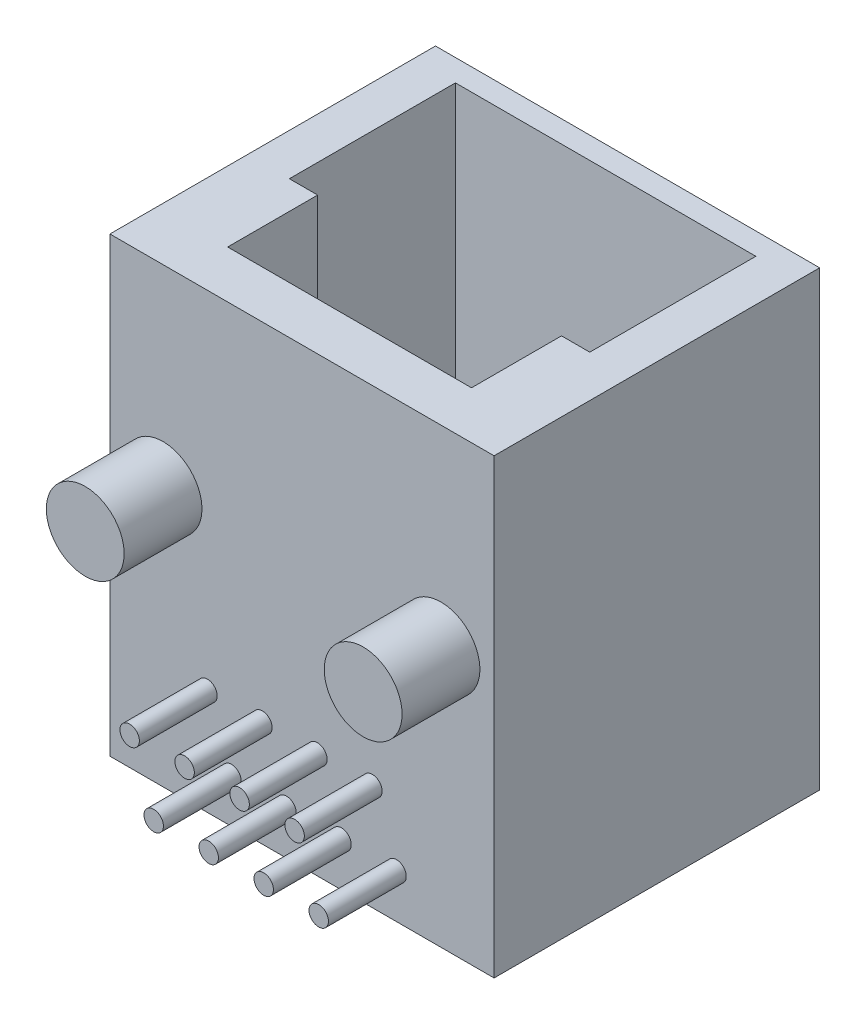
ISO-10303-21;
HEADER;
FILE_DESCRIPTION(('STEP AP214'),'2;1');
FILE_NAME('part.step','',(''),(''),'','','');
FILE_SCHEMA(('AUTOMOTIVE_DESIGN { 1 0 10303 214 1 1 1 1 }'));
ENDSEC;
DATA;
#1=APPLICATION_CONTEXT('core data for automotive mechanical design processes');
#2=APPLICATION_PROTOCOL_DEFINITION('international standard','automotive_design',2000,#1);
#3=PRODUCT_CONTEXT('',#1,'mechanical');
#4=PRODUCT('Part','Part','',(#3));
#5=PRODUCT_RELATED_PRODUCT_CATEGORY('part','',(#4));
#6=PRODUCT_DEFINITION_FORMATION('','',#4);
#7=PRODUCT_DEFINITION_CONTEXT('part definition',#1,'design');
#8=PRODUCT_DEFINITION('design','',#6,#7);
#9=PRODUCT_DEFINITION_SHAPE('','',#8);
#10=(LENGTH_UNIT() NAMED_UNIT(*) SI_UNIT(.MILLI.,.METRE.));
#11=(NAMED_UNIT(*) PLANE_ANGLE_UNIT() SI_UNIT($,.RADIAN.));
#12=(NAMED_UNIT(*) SI_UNIT($,.STERADIAN.) SOLID_ANGLE_UNIT());
#13=UNCERTAINTY_MEASURE_WITH_UNIT(LENGTH_MEASURE(1.E-05),#10,'distance_accuracy_value','');
#14=(GEOMETRIC_REPRESENTATION_CONTEXT(3) GLOBAL_UNCERTAINTY_ASSIGNED_CONTEXT((#13)) GLOBAL_UNIT_ASSIGNED_CONTEXT((#10,
#11,#12)) REPRESENTATION_CONTEXT('',''));
#15=CARTESIAN_POINT('',(0.,0.,0.));
#16=DIRECTION('',(0.,0.,1.));
#17=DIRECTION('',(1.,0.,0.));
#18=AXIS2_PLACEMENT_3D('',#15,#16,#17);
#19=CARTESIAN_POINT('',(7.9,18.6,6.695));
#20=DIRECTION('',(-1.,0.,0.));
#21=DIRECTION('',(0.,0.,1.));
#22=AXIS2_PLACEMENT_3D('',#19,#20,#21);
#23=PLANE('',#22);
#24=DIRECTION('',(0.,0.,-1.));
#25=VECTOR('',#24,1.);
#26=CARTESIAN_POINT('',(7.9,0.,6.695));
#27=LINE('',#26,#25);
#28=CARTESIAN_POINT('',(7.9,0.,6.695));
#29=VERTEX_POINT('',#28);
#30=CARTESIAN_POINT('',(7.9,0.,-6.695));
#31=VERTEX_POINT('',#30);
#32=EDGE_CURVE('E222',#29,#31,#27,.T.);
#33=ORIENTED_EDGE('',*,*,#32,.T.);
#34=DIRECTION('',(0.,-1.,0.));
#35=VECTOR('',#34,1.);
#36=CARTESIAN_POINT('',(7.9,18.6,-6.695));
#37=LINE('',#36,#35);
#38=CARTESIAN_POINT('',(7.9,18.6,-6.695));
#39=VERTEX_POINT('',#38);
#40=EDGE_CURVE('E271',#39,#31,#37,.T.);
#41=ORIENTED_EDGE('',*,*,#40,.F.);
#42=DIRECTION('',(0.,0.,-1.));
#43=VECTOR('',#42,1.);
#44=CARTESIAN_POINT('',(7.9,18.6,6.695));
#45=LINE('',#44,#43);
#46=CARTESIAN_POINT('',(7.9,18.6,6.695));
#47=VERTEX_POINT('',#46);
#48=EDGE_CURVE('E240',#47,#39,#45,.T.);
#49=ORIENTED_EDGE('',*,*,#48,.F.);
#50=DIRECTION('',(0.,-1.,0.));
#51=VECTOR('',#50,1.);
#52=CARTESIAN_POINT('',(7.9,18.6,6.695));
#53=LINE('',#52,#51);
#54=EDGE_CURVE('E250',#47,#29,#53,.T.);
#55=ORIENTED_EDGE('',*,*,#54,.T.);
#56=EDGE_LOOP('',(#33,#41,#49,#55));
#57=FACE_BOUND('',#56,.T.);
#58=ADVANCED_FACE('F43',(#57),#23,.F.);
#59=CARTESIAN_POINT('',(-7.9,18.6,-6.695));
#60=DIRECTION('',(0.,0.,1.));
#61=DIRECTION('',(1.,0.,0.));
#62=AXIS2_PLACEMENT_3D('',#59,#60,#61);
#63=PLANE('',#62);
#64=DIRECTION('',(-1.,0.,0.));
#65=VECTOR('',#64,1.);
#66=CARTESIAN_POINT('',(-7.9,0.,-6.695));
#67=LINE('',#66,#65);
#68=CARTESIAN_POINT('',(-7.9,0.,-6.695));
#69=VERTEX_POINT('',#68);
#70=EDGE_CURVE('E254',#31,#69,#67,.T.);
#71=ORIENTED_EDGE('',*,*,#70,.T.);
#72=DIRECTION('',(0.,-1.,0.));
#73=VECTOR('',#72,1.);
#74=CARTESIAN_POINT('',(-7.9,18.6,-6.695));
#75=LINE('',#74,#73);
#76=CARTESIAN_POINT('',(-7.9,18.6,-6.695));
#77=VERTEX_POINT('',#76);
#78=EDGE_CURVE('E267',#77,#69,#75,.T.);
#79=ORIENTED_EDGE('',*,*,#78,.F.);
#80=DIRECTION('',(-1.,0.,0.));
#81=VECTOR('',#80,1.);
#82=CARTESIAN_POINT('',(-7.9,18.6,-6.695));
#83=LINE('',#82,#81);
#84=EDGE_CURVE('E96',#39,#77,#83,.T.);
#85=ORIENTED_EDGE('',*,*,#84,.F.);
#86=ORIENTED_EDGE('',*,*,#40,.T.);
#87=EDGE_LOOP('',(#71,#79,#85,#86));
#88=FACE_BOUND('',#87,.T.);
#89=ADVANCED_FACE('F349',(#88),#63,.F.);
#90=CARTESIAN_POINT('',(-7.9,18.6,6.695));
#91=DIRECTION('',(1.,0.,0.));
#92=DIRECTION('',(0.,0.,-1.));
#93=AXIS2_PLACEMENT_3D('',#90,#91,#92);
#94=PLANE('',#93);
#95=DIRECTION('',(0.,0.,1.));
#96=VECTOR('',#95,1.);
#97=CARTESIAN_POINT('',(-7.9,0.,6.695));
#98=LINE('',#97,#96);
#99=CARTESIAN_POINT('',(-7.9,0.,6.695));
#100=VERTEX_POINT('',#99);
#101=EDGE_CURVE('E257',#69,#100,#98,.T.);
#102=ORIENTED_EDGE('',*,*,#101,.T.);
#103=DIRECTION('',(0.,-1.,0.));
#104=VECTOR('',#103,1.);
#105=CARTESIAN_POINT('',(-7.9,18.6,6.695));
#106=LINE('',#105,#104);
#107=CARTESIAN_POINT('',(-7.9,18.6,6.695));
#108=VERTEX_POINT('',#107);
#109=EDGE_CURVE('E264',#108,#100,#106,.T.);
#110=ORIENTED_EDGE('',*,*,#109,.F.);
#111=DIRECTION('',(0.,0.,1.));
#112=VECTOR('',#111,1.);
#113=CARTESIAN_POINT('',(-7.9,18.6,6.695));
#114=LINE('',#113,#112);
#115=EDGE_CURVE('E245',#77,#108,#114,.T.);
#116=ORIENTED_EDGE('',*,*,#115,.F.);
#117=ORIENTED_EDGE('',*,*,#78,.T.);
#118=EDGE_LOOP('',(#102,#110,#116,#117));
#119=FACE_BOUND('',#118,.T.);
#120=ADVANCED_FACE('F315',(#119),#94,.F.);
#121=CARTESIAN_POINT('',(-7.9,18.6,6.695));
#122=DIRECTION('',(0.,0.,-1.));
#123=DIRECTION('',(-1.,0.,0.));
#124=AXIS2_PLACEMENT_3D('',#121,#122,#123);
#125=PLANE('',#124);
#126=CARTESIAN_POINT('',(-2.89797,1.81,6.695));
#127=DIRECTION('',(0.,0.,-1.));
#128=DIRECTION('',(-1.,0.,0.));
#129=AXIS2_PLACEMENT_3D('',#126,#127,#128);
#130=CIRCLE('',#129,0.4);
#131=CARTESIAN_POINT('',(-3.29797,1.81,6.695));
#132=VERTEX_POINT('',#131);
#133=EDGE_CURVE('E11',#132,#132,#130,.F.);
#134=ORIENTED_EDGE('',*,*,#133,.F.);
#135=EDGE_LOOP('',(#134));
#136=FACE_BOUND('',#135,.T.);
#137=CARTESIAN_POINT('',(-0.635989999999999,1.81,6.695));
#138=DIRECTION('',(0.,0.,-1.));
#139=DIRECTION('',(-1.,0.,0.));
#140=AXIS2_PLACEMENT_3D('',#137,#138,#139);
#141=CIRCLE('',#140,0.4);
#142=CARTESIAN_POINT('',(-1.03599,1.81,6.695));
#143=VERTEX_POINT('',#142);
#144=EDGE_CURVE('E51',#143,#143,#141,.F.);
#145=ORIENTED_EDGE('',*,*,#144,.F.);
#146=EDGE_LOOP('',(#145));
#147=FACE_BOUND('',#146,.T.);
#148=CARTESIAN_POINT('',(1.62599,1.81,6.695));
#149=DIRECTION('',(0.,0.,-1.));
#150=DIRECTION('',(-1.,0.,0.));
#151=AXIS2_PLACEMENT_3D('',#148,#149,#150);
#152=CIRCLE('',#151,0.4);
#153=CARTESIAN_POINT('',(1.22599,1.81,6.695));
#154=VERTEX_POINT('',#153);
#155=EDGE_CURVE('E302',#154,#154,#152,.F.);
#156=ORIENTED_EDGE('',*,*,#155,.F.);
#157=EDGE_LOOP('',(#156));
#158=FACE_BOUND('',#157,.T.);
#159=CARTESIAN_POINT('',(3.88797,1.81,6.695));
#160=DIRECTION('',(0.,0.,-1.));
#161=DIRECTION('',(-1.,0.,0.));
#162=AXIS2_PLACEMENT_3D('',#159,#160,#161);
#163=CIRCLE('',#162,0.4);
#164=CARTESIAN_POINT('',(3.48797,1.81,6.695));
#165=VERTEX_POINT('',#164);
#166=EDGE_CURVE('E298',#165,#165,#163,.F.);
#167=ORIENTED_EDGE('',*,*,#166,.F.);
#168=EDGE_LOOP('',(#167));
#169=FACE_BOUND('',#168,.T.);
#170=CARTESIAN_POINT('',(-1.62797,4.35,6.695));
#171=DIRECTION('',(0.,0.,-1.));
#172=DIRECTION('',(-1.,0.,0.));
#173=AXIS2_PLACEMENT_3D('',#170,#171,#172);
#174=CIRCLE('',#173,0.4);
#175=CARTESIAN_POINT('',(-2.02797,4.35,6.695));
#176=VERTEX_POINT('',#175);
#177=EDGE_CURVE('E294',#176,#176,#174,.F.);
#178=ORIENTED_EDGE('',*,*,#177,.F.);
#179=EDGE_LOOP('',(#178));
#180=FACE_BOUND('',#179,.T.);
#181=CARTESIAN_POINT('',(0.634010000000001,4.35,6.695));
#182=DIRECTION('',(0.,0.,-1.));
#183=DIRECTION('',(-1.,0.,0.));
#184=AXIS2_PLACEMENT_3D('',#181,#182,#183);
#185=CIRCLE('',#184,0.4);
#186=CARTESIAN_POINT('',(0.234010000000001,4.35,6.695));
#187=VERTEX_POINT('',#186);
#188=EDGE_CURVE('E290',#187,#187,#185,.F.);
#189=ORIENTED_EDGE('',*,*,#188,.F.);
#190=EDGE_LOOP('',(#189));
#191=FACE_BOUND('',#190,.T.);
#192=CARTESIAN_POINT('',(2.89599,4.35,6.695));
#193=DIRECTION('',(0.,0.,-1.));
#194=DIRECTION('',(-1.,0.,0.));
#195=AXIS2_PLACEMENT_3D('',#192,#193,#194);
#196=CIRCLE('',#195,0.4);
#197=CARTESIAN_POINT('',(2.49599,4.35,6.695));
#198=VERTEX_POINT('',#197);
#199=EDGE_CURVE('E286',#198,#198,#196,.F.);
#200=ORIENTED_EDGE('',*,*,#199,.F.);
#201=EDGE_LOOP('',(#200));
#202=FACE_BOUND('',#201,.T.);
#203=CARTESIAN_POINT('',(-3.88797,4.35,6.695));
#204=DIRECTION('',(0.,0.,-1.));
#205=DIRECTION('',(-1.,0.,0.));
#206=AXIS2_PLACEMENT_3D('',#203,#204,#205);
#207=CIRCLE('',#206,0.4);
#208=CARTESIAN_POINT('',(-4.28797,4.35,6.695));
#209=VERTEX_POINT('',#208);
#210=EDGE_CURVE('E282',#209,#209,#207,.F.);
#211=ORIENTED_EDGE('',*,*,#210,.F.);
#212=EDGE_LOOP('',(#211));
#213=FACE_BOUND('',#212,.T.);
#214=CARTESIAN_POINT('',(5.715,10.7,6.695));
#215=DIRECTION('',(0.,0.,-1.));
#216=DIRECTION('',(-1.,0.,0.));
#217=AXIS2_PLACEMENT_3D('',#214,#215,#216);
#218=CIRCLE('',#217,1.6);
#219=CARTESIAN_POINT('',(4.115,10.7,6.695));
#220=VERTEX_POINT('',#219);
#221=EDGE_CURVE('E278',#220,#220,#218,.F.);
#222=ORIENTED_EDGE('',*,*,#221,.F.);
#223=EDGE_LOOP('',(#222));
#224=FACE_BOUND('',#223,.T.);
#225=CARTESIAN_POINT('',(-5.715,10.7,6.695));
#226=DIRECTION('',(0.,0.,-1.));
#227=DIRECTION('',(-1.,0.,0.));
#228=AXIS2_PLACEMENT_3D('',#225,#226,#227);
#229=CIRCLE('',#228,1.6);
#230=CARTESIAN_POINT('',(-7.315,10.7,6.695));
#231=VERTEX_POINT('',#230);
#232=EDGE_CURVE('E274',#231,#231,#229,.F.);
#233=ORIENTED_EDGE('',*,*,#232,.F.);
#234=EDGE_LOOP('',(#233));
#235=FACE_BOUND('',#234,.T.);
#236=DIRECTION('',(1.,0.,0.));
#237=VECTOR('',#236,1.);
#238=CARTESIAN_POINT('',(-7.9,0.,6.695));
#239=LINE('',#238,#237);
#240=EDGE_CURVE('E88',#100,#29,#239,.T.);
#241=ORIENTED_EDGE('',*,*,#240,.T.);
#242=ORIENTED_EDGE('',*,*,#54,.F.);
#243=DIRECTION('',(1.,0.,0.));
#244=VECTOR('',#243,1.);
#245=CARTESIAN_POINT('',(-7.9,18.6,6.695));
#246=LINE('',#245,#244);
#247=EDGE_CURVE('E67',#108,#47,#246,.T.);
#248=ORIENTED_EDGE('',*,*,#247,.F.);
#249=ORIENTED_EDGE('',*,*,#109,.T.);
#250=EDGE_LOOP('',(#241,#242,#248,#249));
#251=FACE_BOUND('',#250,.T.);
#252=ADVANCED_FACE('F311',(#136,#147,#158,#169,#180,#191,#202,#213,#224,#235,#251),#125,.F.);
#253=CARTESIAN_POINT('',(0.,18.6,0.));
#254=DIRECTION('',(0.,-1.,0.));
#255=DIRECTION('',(0.,0.,-1.));
#256=AXIS2_PLACEMENT_3D('',#253,#254,#255);
#257=PLANE('',#256);
#258=DIRECTION('',(-1.,0.,0.));
#259=VECTOR('',#258,1.);
#260=CARTESIAN_POINT('',(-6.17696518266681,18.6,-5.79258095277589));
#261=LINE('',#260,#259);
#262=CARTESIAN_POINT('',(6.17696518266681,18.6,-5.79258095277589));
#263=VERTEX_POINT('',#262);
#264=CARTESIAN_POINT('',(-6.17696518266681,18.6,-5.79258095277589));
#265=VERTEX_POINT('',#264);
#266=EDGE_CURVE('E197',#263,#265,#261,.T.);
#267=ORIENTED_EDGE('',*,*,#266,.F.);
#268=DIRECTION('',(0.,0.,-1.));
#269=VECTOR('',#268,1.);
#270=CARTESIAN_POINT('',(6.17696518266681,18.6,1.0369435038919));
#271=LINE('',#270,#269);
#272=CARTESIAN_POINT('',(6.17696518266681,18.6,1.0369435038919));
#273=VERTEX_POINT('',#272);
#274=EDGE_CURVE('E58',#273,#263,#271,.T.);
#275=ORIENTED_EDGE('',*,*,#274,.F.);
#276=DIRECTION('',(1.,0.,0.));
#277=VECTOR('',#276,1.);
#278=CARTESIAN_POINT('',(5.01487332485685,18.6,1.0369435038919));
#279=LINE('',#278,#277);
#280=CARTESIAN_POINT('',(5.01487332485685,18.6,1.0369435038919));
#281=VERTEX_POINT('',#280);
#282=EDGE_CURVE('E166',#281,#273,#279,.T.);
#283=ORIENTED_EDGE('',*,*,#282,.F.);
#284=DIRECTION('',(0.,0.,-1.));
#285=VECTOR('',#284,1.);
#286=CARTESIAN_POINT('',(5.01487332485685,18.6,4.73775911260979));
#287=LINE('',#286,#285);
#288=CARTESIAN_POINT('',(5.01487332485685,18.6,4.73775911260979));
#289=VERTEX_POINT('',#288);
#290=EDGE_CURVE('E170',#289,#281,#287,.T.);
#291=ORIENTED_EDGE('',*,*,#290,.F.);
#292=DIRECTION('',(1.,0.,0.));
#293=VECTOR('',#292,1.);
#294=CARTESIAN_POINT('',(-5.01487332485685,18.6,4.73775911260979));
#295=LINE('',#294,#293);
#296=CARTESIAN_POINT('',(-5.01487332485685,18.6,4.73775911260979));
#297=VERTEX_POINT('',#296);
#298=EDGE_CURVE('E212',#297,#289,#295,.T.);
#299=ORIENTED_EDGE('',*,*,#298,.F.);
#300=DIRECTION('',(0.,0.,1.));
#301=VECTOR('',#300,1.);
#302=CARTESIAN_POINT('',(-5.01487332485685,18.6,4.73775911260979));
#303=LINE('',#302,#301);
#304=CARTESIAN_POINT('',(-5.01487332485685,18.6,1.0369435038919));
#305=VERTEX_POINT('',#304);
#306=EDGE_CURVE('E208',#305,#297,#303,.T.);
#307=ORIENTED_EDGE('',*,*,#306,.F.);
#308=DIRECTION('',(1.,0.,0.));
#309=VECTOR('',#308,1.);
#310=CARTESIAN_POINT('',(-6.17696518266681,18.6,1.0369435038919));
#311=LINE('',#310,#309);
#312=CARTESIAN_POINT('',(-6.17696518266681,18.6,1.0369435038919));
#313=VERTEX_POINT('',#312);
#314=EDGE_CURVE('E204',#313,#305,#311,.T.);
#315=ORIENTED_EDGE('',*,*,#314,.F.);
#316=DIRECTION('',(0.,0.,1.));
#317=VECTOR('',#316,1.);
#318=CARTESIAN_POINT('',(-6.17696518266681,18.6,1.0369435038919));
#319=LINE('',#318,#317);
#320=EDGE_CURVE('E200',#265,#313,#319,.T.);
#321=ORIENTED_EDGE('',*,*,#320,.F.);
#322=EDGE_LOOP('',(#267,#275,#283,#291,#299,#307,#315,#321));
#323=FACE_BOUND('',#322,.T.);
#324=ORIENTED_EDGE('',*,*,#48,.T.);
#325=ORIENTED_EDGE('',*,*,#84,.T.);
#326=ORIENTED_EDGE('',*,*,#115,.T.);
#327=ORIENTED_EDGE('',*,*,#247,.T.);
#328=EDGE_LOOP('',(#324,#325,#326,#327));
#329=FACE_BOUND('',#328,.T.);
#330=ADVANCED_FACE('F314',(#323,#329),#257,.F.);
#331=CARTESIAN_POINT('',(0.,0.,0.));
#332=DIRECTION('',(0.,-1.,0.));
#333=DIRECTION('',(0.,0.,-1.));
#334=AXIS2_PLACEMENT_3D('',#331,#332,#333);
#335=PLANE('',#334);
#336=ORIENTED_EDGE('',*,*,#32,.F.);
#337=ORIENTED_EDGE('',*,*,#240,.F.);
#338=ORIENTED_EDGE('',*,*,#101,.F.);
#339=ORIENTED_EDGE('',*,*,#70,.F.);
#340=EDGE_LOOP('',(#336,#337,#338,#339));
#341=FACE_BOUND('',#340,.T.);
#342=ADVANCED_FACE('F358',(#341),#335,.T.);
#343=CARTESIAN_POINT('',(6.17696518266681,4.,1.0369435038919));
#344=DIRECTION('',(1.,0.,0.));
#345=DIRECTION('',(0.,0.,-1.));
#346=AXIS2_PLACEMENT_3D('',#343,#344,#345);
#347=PLANE('',#346);
#348=ORIENTED_EDGE('',*,*,#274,.T.);
#349=DIRECTION('',(0.,1.,0.));
#350=VECTOR('',#349,1.);
#351=CARTESIAN_POINT('',(6.17696518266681,4.,-5.79258095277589));
#352=LINE('',#351,#350);
#353=CARTESIAN_POINT('',(6.17696518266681,4.,-5.79258095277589));
#354=VERTEX_POINT('',#353);
#355=EDGE_CURVE('E140',#354,#263,#352,.T.);
#356=ORIENTED_EDGE('',*,*,#355,.F.);
#357=DIRECTION('',(0.,0.,-1.));
#358=VECTOR('',#357,1.);
#359=CARTESIAN_POINT('',(6.17696518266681,4.,1.0369435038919));
#360=LINE('',#359,#358);
#361=CARTESIAN_POINT('',(6.17696518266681,4.,1.0369435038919));
#362=VERTEX_POINT('',#361);
#363=EDGE_CURVE('E144',#362,#354,#360,.T.);
#364=ORIENTED_EDGE('',*,*,#363,.F.);
#365=DIRECTION('',(0.,1.,0.));
#366=VECTOR('',#365,1.);
#367=CARTESIAN_POINT('',(6.17696518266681,4.,1.0369435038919));
#368=LINE('',#367,#366);
#369=EDGE_CURVE('E219',#362,#273,#368,.T.);
#370=ORIENTED_EDGE('',*,*,#369,.T.);
#371=EDGE_LOOP('',(#348,#356,#364,#370));
#372=FACE_BOUND('',#371,.T.);
#373=ADVANCED_FACE('F142',(#372),#347,.F.);
#374=CARTESIAN_POINT('',(5.01487332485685,4.,1.0369435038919));
#375=DIRECTION('',(0.,0.,1.));
#376=DIRECTION('',(1.,0.,0.));
#377=AXIS2_PLACEMENT_3D('',#374,#375,#376);
#378=PLANE('',#377);
#379=ORIENTED_EDGE('',*,*,#282,.T.);
#380=ORIENTED_EDGE('',*,*,#369,.F.);
#381=DIRECTION('',(1.,0.,0.));
#382=VECTOR('',#381,1.);
#383=CARTESIAN_POINT('',(5.01487332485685,4.,1.0369435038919));
#384=LINE('',#383,#382);
#385=CARTESIAN_POINT('',(5.01487332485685,4.,1.0369435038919));
#386=VERTEX_POINT('',#385);
#387=EDGE_CURVE('E151',#386,#362,#384,.T.);
#388=ORIENTED_EDGE('',*,*,#387,.F.);
#389=DIRECTION('',(0.,1.,0.));
#390=VECTOR('',#389,1.);
#391=CARTESIAN_POINT('',(5.01487332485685,4.,1.0369435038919));
#392=LINE('',#391,#390);
#393=EDGE_CURVE('E223',#386,#281,#392,.T.);
#394=ORIENTED_EDGE('',*,*,#393,.T.);
#395=EDGE_LOOP('',(#379,#380,#388,#394));
#396=FACE_BOUND('',#395,.T.);
#397=ADVANCED_FACE('F677',(#396),#378,.F.);
#398=CARTESIAN_POINT('',(5.01487332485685,4.,4.73775911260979));
#399=DIRECTION('',(1.,0.,0.));
#400=DIRECTION('',(0.,0.,-1.));
#401=AXIS2_PLACEMENT_3D('',#398,#399,#400);
#402=PLANE('',#401);
#403=ORIENTED_EDGE('',*,*,#290,.T.);
#404=ORIENTED_EDGE('',*,*,#393,.F.);
#405=DIRECTION('',(0.,0.,-1.));
#406=VECTOR('',#405,1.);
#407=CARTESIAN_POINT('',(5.01487332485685,4.,4.73775911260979));
#408=LINE('',#407,#406);
#409=CARTESIAN_POINT('',(5.01487332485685,4.,4.73775911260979));
#410=VERTEX_POINT('',#409);
#411=EDGE_CURVE('E190',#410,#386,#408,.T.);
#412=ORIENTED_EDGE('',*,*,#411,.F.);
#413=DIRECTION('',(0.,1.,0.));
#414=VECTOR('',#413,1.);
#415=CARTESIAN_POINT('',(5.01487332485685,4.,4.73775911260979));
#416=LINE('',#415,#414);
#417=EDGE_CURVE('E226',#410,#289,#416,.T.);
#418=ORIENTED_EDGE('',*,*,#417,.T.);
#419=EDGE_LOOP('',(#403,#404,#412,#418));
#420=FACE_BOUND('',#419,.T.);
#421=ADVANCED_FACE('F667',(#420),#402,.F.);
#422=CARTESIAN_POINT('',(-5.01487332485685,4.,4.73775911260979));
#423=DIRECTION('',(0.,0.,1.));
#424=DIRECTION('',(1.,0.,0.));
#425=AXIS2_PLACEMENT_3D('',#422,#423,#424);
#426=PLANE('',#425);
#427=ORIENTED_EDGE('',*,*,#298,.T.);
#428=ORIENTED_EDGE('',*,*,#417,.F.);
#429=DIRECTION('',(1.,0.,0.));
#430=VECTOR('',#429,1.);
#431=CARTESIAN_POINT('',(-5.01487332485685,4.,4.73775911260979));
#432=LINE('',#431,#430);
#433=CARTESIAN_POINT('',(-5.01487332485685,4.,4.73775911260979));
#434=VERTEX_POINT('',#433);
#435=EDGE_CURVE('E186',#434,#410,#432,.T.);
#436=ORIENTED_EDGE('',*,*,#435,.F.);
#437=DIRECTION('',(0.,1.,0.));
#438=VECTOR('',#437,1.);
#439=CARTESIAN_POINT('',(-5.01487332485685,4.,4.73775911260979));
#440=LINE('',#439,#438);
#441=EDGE_CURVE('E229',#434,#297,#440,.T.);
#442=ORIENTED_EDGE('',*,*,#441,.T.);
#443=EDGE_LOOP('',(#427,#428,#436,#442));
#444=FACE_BOUND('',#443,.T.);
#445=ADVANCED_FACE('F657',(#444),#426,.F.);
#446=CARTESIAN_POINT('',(-5.01487332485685,4.,4.73775911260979));
#447=DIRECTION('',(-1.,0.,0.));
#448=DIRECTION('',(0.,0.,1.));
#449=AXIS2_PLACEMENT_3D('',#446,#447,#448);
#450=PLANE('',#449);
#451=ORIENTED_EDGE('',*,*,#306,.T.);
#452=ORIENTED_EDGE('',*,*,#441,.F.);
#453=DIRECTION('',(0.,0.,1.));
#454=VECTOR('',#453,1.);
#455=CARTESIAN_POINT('',(-5.01487332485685,4.,4.73775911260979));
#456=LINE('',#455,#454);
#457=CARTESIAN_POINT('',(-5.01487332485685,4.,1.0369435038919));
#458=VERTEX_POINT('',#457);
#459=EDGE_CURVE('E182',#458,#434,#456,.T.);
#460=ORIENTED_EDGE('',*,*,#459,.F.);
#461=DIRECTION('',(0.,1.,0.));
#462=VECTOR('',#461,1.);
#463=CARTESIAN_POINT('',(-5.01487332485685,4.,1.0369435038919));
#464=LINE('',#463,#462);
#465=EDGE_CURVE('E232',#458,#305,#464,.T.);
#466=ORIENTED_EDGE('',*,*,#465,.T.);
#467=EDGE_LOOP('',(#451,#452,#460,#466));
#468=FACE_BOUND('',#467,.T.);
#469=ADVANCED_FACE('F647',(#468),#450,.F.);
#470=CARTESIAN_POINT('',(-6.17696518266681,4.,1.0369435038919));
#471=DIRECTION('',(0.,0.,1.));
#472=DIRECTION('',(1.,0.,0.));
#473=AXIS2_PLACEMENT_3D('',#470,#471,#472);
#474=PLANE('',#473);
#475=ORIENTED_EDGE('',*,*,#314,.T.);
#476=ORIENTED_EDGE('',*,*,#465,.F.);
#477=DIRECTION('',(1.,0.,0.));
#478=VECTOR('',#477,1.);
#479=CARTESIAN_POINT('',(-6.17696518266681,4.,1.0369435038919));
#480=LINE('',#479,#478);
#481=CARTESIAN_POINT('',(-6.17696518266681,4.,1.0369435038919));
#482=VERTEX_POINT('',#481);
#483=EDGE_CURVE('E178',#482,#458,#480,.T.);
#484=ORIENTED_EDGE('',*,*,#483,.F.);
#485=DIRECTION('',(0.,1.,0.));
#486=VECTOR('',#485,1.);
#487=CARTESIAN_POINT('',(-6.17696518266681,4.,1.0369435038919));
#488=LINE('',#487,#486);
#489=EDGE_CURVE('E235',#482,#313,#488,.T.);
#490=ORIENTED_EDGE('',*,*,#489,.T.);
#491=EDGE_LOOP('',(#475,#476,#484,#490));
#492=FACE_BOUND('',#491,.T.);
#493=ADVANCED_FACE('F637',(#492),#474,.F.);
#494=CARTESIAN_POINT('',(-6.17696518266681,4.,1.0369435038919));
#495=DIRECTION('',(-1.,0.,0.));
#496=DIRECTION('',(0.,0.,1.));
#497=AXIS2_PLACEMENT_3D('',#494,#495,#496);
#498=PLANE('',#497);
#499=ORIENTED_EDGE('',*,*,#320,.T.);
#500=ORIENTED_EDGE('',*,*,#489,.F.);
#501=DIRECTION('',(0.,0.,1.));
#502=VECTOR('',#501,1.);
#503=CARTESIAN_POINT('',(-6.17696518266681,4.,1.0369435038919));
#504=LINE('',#503,#502);
#505=CARTESIAN_POINT('',(-6.17696518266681,4.,-5.79258095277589));
#506=VERTEX_POINT('',#505);
#507=EDGE_CURVE('E160',#506,#482,#504,.T.);
#508=ORIENTED_EDGE('',*,*,#507,.F.);
#509=DIRECTION('',(0.,1.,0.));
#510=VECTOR('',#509,1.);
#511=CARTESIAN_POINT('',(-6.17696518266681,4.,-5.79258095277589));
#512=LINE('',#511,#510);
#513=EDGE_CURVE('E150',#506,#265,#512,.T.);
#514=ORIENTED_EDGE('',*,*,#513,.T.);
#515=EDGE_LOOP('',(#499,#500,#508,#514));
#516=FACE_BOUND('',#515,.T.);
#517=ADVANCED_FACE('F630',(#516),#498,.F.);
#518=CARTESIAN_POINT('',(-6.17696518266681,4.,-5.79258095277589));
#519=DIRECTION('',(0.,0.,-1.));
#520=DIRECTION('',(-1.,0.,0.));
#521=AXIS2_PLACEMENT_3D('',#518,#519,#520);
#522=PLANE('',#521);
#523=ORIENTED_EDGE('',*,*,#266,.T.);
#524=ORIENTED_EDGE('',*,*,#513,.F.);
#525=DIRECTION('',(-1.,0.,0.));
#526=VECTOR('',#525,1.);
#527=CARTESIAN_POINT('',(-6.17696518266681,4.,-5.79258095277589));
#528=LINE('',#527,#526);
#529=EDGE_CURVE('E154',#354,#506,#528,.T.);
#530=ORIENTED_EDGE('',*,*,#529,.F.);
#531=ORIENTED_EDGE('',*,*,#355,.T.);
#532=EDGE_LOOP('',(#523,#524,#530,#531));
#533=FACE_BOUND('',#532,.T.);
#534=ADVANCED_FACE('F155',(#533),#522,.F.);
#535=CARTESIAN_POINT('',(0.,4.,0.));
#536=DIRECTION('',(0.,-1.,0.));
#537=DIRECTION('',(0.,0.,-1.));
#538=AXIS2_PLACEMENT_3D('',#535,#536,#537);
#539=PLANE('',#538);
#540=ORIENTED_EDGE('',*,*,#363,.T.);
#541=ORIENTED_EDGE('',*,*,#529,.T.);
#542=ORIENTED_EDGE('',*,*,#507,.T.);
#543=ORIENTED_EDGE('',*,*,#483,.T.);
#544=ORIENTED_EDGE('',*,*,#459,.T.);
#545=ORIENTED_EDGE('',*,*,#435,.T.);
#546=ORIENTED_EDGE('',*,*,#411,.T.);
#547=ORIENTED_EDGE('',*,*,#387,.T.);
#548=EDGE_LOOP('',(#540,#541,#542,#543,#544,#545,#546,#547));
#549=FACE_BOUND('',#548,.T.);
#550=ADVANCED_FACE('F162',(#549),#539,.F.);
#551=CARTESIAN_POINT('',(-5.715,10.7,9.895));
#552=DIRECTION('',(0.,0.,-1.));
#553=DIRECTION('',(-1.,0.,0.));
#554=AXIS2_PLACEMENT_3D('',#551,#552,#553);
#555=CYLINDRICAL_SURFACE('',#554,1.6);
#556=CARTESIAN_POINT('',(-5.715,10.7,9.895));
#557=DIRECTION('',(0.,0.,1.));
#558=DIRECTION('',(1.,0.,0.));
#559=AXIS2_PLACEMENT_3D('',#556,#557,#558);
#560=CIRCLE('',#559,1.6);
#561=CARTESIAN_POINT('',(-4.115,10.7,9.895));
#562=VERTEX_POINT('',#561);
#563=EDGE_CURVE('E173',#562,#562,#560,.T.);
#564=ORIENTED_EDGE('',*,*,#563,.F.);
#565=EDGE_LOOP('',(#564));
#566=FACE_BOUND('',#565,.T.);
#567=ORIENTED_EDGE('',*,*,#232,.T.);
#568=EDGE_LOOP('',(#567));
#569=FACE_BOUND('',#568,.T.);
#570=ADVANCED_FACE('F334',(#566,#569),#555,.T.);
#571=CARTESIAN_POINT('',(-5.715,10.7,9.895));
#572=DIRECTION('',(0.,0.,1.));
#573=DIRECTION('',(1.,0.,0.));
#574=AXIS2_PLACEMENT_3D('',#571,#572,#573);
#575=PLANE('',#574);
#576=ORIENTED_EDGE('',*,*,#563,.T.);
#577=EDGE_LOOP('',(#576));
#578=FACE_BOUND('',#577,.T.);
#579=ADVANCED_FACE('F336',(#578),#575,.T.);
#580=CARTESIAN_POINT('',(5.715,10.7,9.895));
#581=DIRECTION('',(0.,0.,-1.));
#582=DIRECTION('',(-1.,0.,0.));
#583=AXIS2_PLACEMENT_3D('',#580,#581,#582);
#584=CYLINDRICAL_SURFACE('',#583,1.6);
#585=CARTESIAN_POINT('',(5.715,10.7,9.895));
#586=DIRECTION('',(0.,0.,1.));
#587=DIRECTION('',(1.,0.,0.));
#588=AXIS2_PLACEMENT_3D('',#585,#586,#587);
#589=CIRCLE('',#588,1.6);
#590=CARTESIAN_POINT('',(7.315,10.7,9.895));
#591=VERTEX_POINT('',#590);
#592=EDGE_CURVE('E787',#591,#591,#589,.T.);
#593=ORIENTED_EDGE('',*,*,#592,.F.);
#594=EDGE_LOOP('',(#593));
#595=FACE_BOUND('',#594,.T.);
#596=ORIENTED_EDGE('',*,*,#221,.T.);
#597=EDGE_LOOP('',(#596));
#598=FACE_BOUND('',#597,.T.);
#599=ADVANCED_FACE('F343',(#595,#598),#584,.T.);
#600=CARTESIAN_POINT('',(5.715,10.7,9.895));
#601=DIRECTION('',(0.,0.,1.));
#602=DIRECTION('',(1.,0.,0.));
#603=AXIS2_PLACEMENT_3D('',#600,#601,#602);
#604=PLANE('',#603);
#605=ORIENTED_EDGE('',*,*,#592,.T.);
#606=EDGE_LOOP('',(#605));
#607=FACE_BOUND('',#606,.T.);
#608=ADVANCED_FACE('F410',(#607),#604,.T.);
#609=CARTESIAN_POINT('',(-3.88797,4.35,9.895));
#610=DIRECTION('',(0.,0.,-1.));
#611=DIRECTION('',(-1.,0.,0.));
#612=AXIS2_PLACEMENT_3D('',#609,#610,#611);
#613=CYLINDRICAL_SURFACE('',#612,0.4);
#614=CARTESIAN_POINT('',(-3.88797,4.35,9.895));
#615=DIRECTION('',(0.,0.,1.));
#616=DIRECTION('',(1.,0.,0.));
#617=AXIS2_PLACEMENT_3D('',#614,#615,#616);
#618=CIRCLE('',#617,0.4);
#619=CARTESIAN_POINT('',(-3.48797,4.35,9.895));
#620=VERTEX_POINT('',#619);
#621=EDGE_CURVE('E784',#620,#620,#618,.T.);
#622=ORIENTED_EDGE('',*,*,#621,.F.);
#623=EDGE_LOOP('',(#622));
#624=FACE_BOUND('',#623,.T.);
#625=ORIENTED_EDGE('',*,*,#210,.T.);
#626=EDGE_LOOP('',(#625));
#627=FACE_BOUND('',#626,.T.);
#628=ADVANCED_FACE('F421',(#624,#627),#613,.T.);
#629=CARTESIAN_POINT('',(-3.88797,4.35,9.895));
#630=DIRECTION('',(0.,0.,1.));
#631=DIRECTION('',(1.,0.,0.));
#632=AXIS2_PLACEMENT_3D('',#629,#630,#631);
#633=PLANE('',#632);
#634=ORIENTED_EDGE('',*,*,#621,.T.);
#635=EDGE_LOOP('',(#634));
#636=FACE_BOUND('',#635,.T.);
#637=ADVANCED_FACE('F432',(#636),#633,.T.);
#638=CARTESIAN_POINT('',(2.89599,4.35,9.895));
#639=DIRECTION('',(0.,0.,-1.));
#640=DIRECTION('',(-1.,0.,0.));
#641=AXIS2_PLACEMENT_3D('',#638,#639,#640);
#642=CYLINDRICAL_SURFACE('',#641,0.4);
#643=CARTESIAN_POINT('',(2.89599,4.35,9.895));
#644=DIRECTION('',(0.,0.,1.));
#645=DIRECTION('',(1.,0.,0.));
#646=AXIS2_PLACEMENT_3D('',#643,#644,#645);
#647=CIRCLE('',#646,0.4);
#648=CARTESIAN_POINT('',(3.29599,4.35,9.895));
#649=VERTEX_POINT('',#648);
#650=EDGE_CURVE('E780',#649,#649,#647,.T.);
#651=ORIENTED_EDGE('',*,*,#650,.F.);
#652=EDGE_LOOP('',(#651));
#653=FACE_BOUND('',#652,.T.);
#654=ORIENTED_EDGE('',*,*,#199,.T.);
#655=EDGE_LOOP('',(#654));
#656=FACE_BOUND('',#655,.T.);
#657=ADVANCED_FACE('F443',(#653,#656),#642,.T.);
#658=CARTESIAN_POINT('',(2.89599,4.35,9.895));
#659=DIRECTION('',(0.,0.,1.));
#660=DIRECTION('',(1.,0.,0.));
#661=AXIS2_PLACEMENT_3D('',#658,#659,#660);
#662=PLANE('',#661);
#663=ORIENTED_EDGE('',*,*,#650,.T.);
#664=EDGE_LOOP('',(#663));
#665=FACE_BOUND('',#664,.T.);
#666=ADVANCED_FACE('F454',(#665),#662,.T.);
#667=CARTESIAN_POINT('',(0.634010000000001,4.35,9.895));
#668=DIRECTION('',(0.,0.,-1.));
#669=DIRECTION('',(-1.,0.,0.));
#670=AXIS2_PLACEMENT_3D('',#667,#668,#669);
#671=CYLINDRICAL_SURFACE('',#670,0.4);
#672=CARTESIAN_POINT('',(0.634010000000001,4.35,9.895));
#673=DIRECTION('',(0.,0.,1.));
#674=DIRECTION('',(1.,0.,0.));
#675=AXIS2_PLACEMENT_3D('',#672,#673,#674);
#676=CIRCLE('',#675,0.4);
#677=CARTESIAN_POINT('',(1.03401,4.35,9.895));
#678=VERTEX_POINT('',#677);
#679=EDGE_CURVE('E776',#678,#678,#676,.T.);
#680=ORIENTED_EDGE('',*,*,#679,.F.);
#681=EDGE_LOOP('',(#680));
#682=FACE_BOUND('',#681,.T.);
#683=ORIENTED_EDGE('',*,*,#188,.T.);
#684=EDGE_LOOP('',(#683));
#685=FACE_BOUND('',#684,.T.);
#686=ADVANCED_FACE('F465',(#682,#685),#671,.T.);
#687=CARTESIAN_POINT('',(0.634010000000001,4.35,9.895));
#688=DIRECTION('',(0.,0.,1.));
#689=DIRECTION('',(1.,0.,0.));
#690=AXIS2_PLACEMENT_3D('',#687,#688,#689);
#691=PLANE('',#690);
#692=ORIENTED_EDGE('',*,*,#679,.T.);
#693=EDGE_LOOP('',(#692));
#694=FACE_BOUND('',#693,.T.);
#695=ADVANCED_FACE('F476',(#694),#691,.T.);
#696=CARTESIAN_POINT('',(-1.62797,4.35,9.895));
#697=DIRECTION('',(0.,0.,-1.));
#698=DIRECTION('',(-1.,0.,0.));
#699=AXIS2_PLACEMENT_3D('',#696,#697,#698);
#700=CYLINDRICAL_SURFACE('',#699,0.4);
#701=CARTESIAN_POINT('',(-1.62797,4.35,9.895));
#702=DIRECTION('',(0.,0.,1.));
#703=DIRECTION('',(1.,0.,0.));
#704=AXIS2_PLACEMENT_3D('',#701,#702,#703);
#705=CIRCLE('',#704,0.4);
#706=CARTESIAN_POINT('',(-1.22797,4.35,9.895));
#707=VERTEX_POINT('',#706);
#708=EDGE_CURVE('E772',#707,#707,#705,.T.);
#709=ORIENTED_EDGE('',*,*,#708,.F.);
#710=EDGE_LOOP('',(#709));
#711=FACE_BOUND('',#710,.T.);
#712=ORIENTED_EDGE('',*,*,#177,.T.);
#713=EDGE_LOOP('',(#712));
#714=FACE_BOUND('',#713,.T.);
#715=ADVANCED_FACE('F487',(#711,#714),#700,.T.);
#716=CARTESIAN_POINT('',(-1.62797,4.35,9.895));
#717=DIRECTION('',(0.,0.,1.));
#718=DIRECTION('',(1.,0.,0.));
#719=AXIS2_PLACEMENT_3D('',#716,#717,#718);
#720=PLANE('',#719);
#721=ORIENTED_EDGE('',*,*,#708,.T.);
#722=EDGE_LOOP('',(#721));
#723=FACE_BOUND('',#722,.T.);
#724=ADVANCED_FACE('F498',(#723),#720,.T.);
#725=CARTESIAN_POINT('',(3.88797,1.81,9.895));
#726=DIRECTION('',(0.,0.,-1.));
#727=DIRECTION('',(-1.,0.,0.));
#728=AXIS2_PLACEMENT_3D('',#725,#726,#727);
#729=CYLINDRICAL_SURFACE('',#728,0.4);
#730=CARTESIAN_POINT('',(3.88797,1.81,9.895));
#731=DIRECTION('',(0.,0.,1.));
#732=DIRECTION('',(1.,0.,0.));
#733=AXIS2_PLACEMENT_3D('',#730,#731,#732);
#734=CIRCLE('',#733,0.4);
#735=CARTESIAN_POINT('',(4.28797,1.81,9.895));
#736=VERTEX_POINT('',#735);
#737=EDGE_CURVE('E768',#736,#736,#734,.T.);
#738=ORIENTED_EDGE('',*,*,#737,.F.);
#739=EDGE_LOOP('',(#738));
#740=FACE_BOUND('',#739,.T.);
#741=ORIENTED_EDGE('',*,*,#166,.T.);
#742=EDGE_LOOP('',(#741));
#743=FACE_BOUND('',#742,.T.);
#744=ADVANCED_FACE('F509',(#740,#743),#729,.T.);
#745=CARTESIAN_POINT('',(3.88797,1.81,9.895));
#746=DIRECTION('',(0.,0.,1.));
#747=DIRECTION('',(1.,0.,0.));
#748=AXIS2_PLACEMENT_3D('',#745,#746,#747);
#749=PLANE('',#748);
#750=ORIENTED_EDGE('',*,*,#737,.T.);
#751=EDGE_LOOP('',(#750));
#752=FACE_BOUND('',#751,.T.);
#753=ADVANCED_FACE('F520',(#752),#749,.T.);
#754=CARTESIAN_POINT('',(1.62599,1.81,9.895));
#755=DIRECTION('',(0.,0.,-1.));
#756=DIRECTION('',(-1.,0.,0.));
#757=AXIS2_PLACEMENT_3D('',#754,#755,#756);
#758=CYLINDRICAL_SURFACE('',#757,0.4);
#759=CARTESIAN_POINT('',(1.62599,1.81,9.895));
#760=DIRECTION('',(0.,0.,1.));
#761=DIRECTION('',(1.,0.,0.));
#762=AXIS2_PLACEMENT_3D('',#759,#760,#761);
#763=CIRCLE('',#762,0.4);
#764=CARTESIAN_POINT('',(2.02599,1.81,9.895));
#765=VERTEX_POINT('',#764);
#766=EDGE_CURVE('E762',#765,#765,#763,.T.);
#767=ORIENTED_EDGE('',*,*,#766,.F.);
#768=EDGE_LOOP('',(#767));
#769=FACE_BOUND('',#768,.T.);
#770=ORIENTED_EDGE('',*,*,#155,.T.);
#771=EDGE_LOOP('',(#770));
#772=FACE_BOUND('',#771,.T.);
#773=ADVANCED_FACE('F531',(#769,#772),#758,.T.);
#774=CARTESIAN_POINT('',(1.62599,1.81,9.895));
#775=DIRECTION('',(0.,0.,1.));
#776=DIRECTION('',(1.,0.,0.));
#777=AXIS2_PLACEMENT_3D('',#774,#775,#776);
#778=PLANE('',#777);
#779=ORIENTED_EDGE('',*,*,#766,.T.);
#780=EDGE_LOOP('',(#779));
#781=FACE_BOUND('',#780,.T.);
#782=ADVANCED_FACE('F542',(#781),#778,.T.);
#783=CARTESIAN_POINT('',(-0.635989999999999,1.81,9.895));
#784=DIRECTION('',(0.,0.,-1.));
#785=DIRECTION('',(-1.,0.,0.));
#786=AXIS2_PLACEMENT_3D('',#783,#784,#785);
#787=CYLINDRICAL_SURFACE('',#786,0.4);
#788=CARTESIAN_POINT('',(-0.635989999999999,1.81,9.895));
#789=DIRECTION('',(0.,0.,1.));
#790=DIRECTION('',(1.,0.,0.));
#791=AXIS2_PLACEMENT_3D('',#788,#789,#790);
#792=CIRCLE('',#791,0.4);
#793=CARTESIAN_POINT('',(-0.235989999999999,1.81,9.895));
#794=VERTEX_POINT('',#793);
#795=EDGE_CURVE('E758',#794,#794,#792,.T.);
#796=ORIENTED_EDGE('',*,*,#795,.F.);
#797=EDGE_LOOP('',(#796));
#798=FACE_BOUND('',#797,.T.);
#799=ORIENTED_EDGE('',*,*,#144,.T.);
#800=EDGE_LOOP('',(#799));
#801=FACE_BOUND('',#800,.T.);
#802=ADVANCED_FACE('F309',(#798,#801),#787,.T.);
#803=CARTESIAN_POINT('',(-0.635989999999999,1.81,9.895));
#804=DIRECTION('',(0.,0.,1.));
#805=DIRECTION('',(1.,0.,0.));
#806=AXIS2_PLACEMENT_3D('',#803,#804,#805);
#807=PLANE('',#806);
#808=ORIENTED_EDGE('',*,*,#795,.T.);
#809=EDGE_LOOP('',(#808));
#810=FACE_BOUND('',#809,.T.);
#811=ADVANCED_FACE('F563',(#810),#807,.T.);
#812=CARTESIAN_POINT('',(-2.89797,1.81,9.895));
#813=DIRECTION('',(0.,0.,-1.));
#814=DIRECTION('',(-1.,0.,0.));
#815=AXIS2_PLACEMENT_3D('',#812,#813,#814);
#816=CYLINDRICAL_SURFACE('',#815,0.4);
#817=CARTESIAN_POINT('',(-2.89797,1.81,9.895));
#818=DIRECTION('',(0.,0.,1.));
#819=DIRECTION('',(1.,0.,0.));
#820=AXIS2_PLACEMENT_3D('',#817,#818,#819);
#821=CIRCLE('',#820,0.4);
#822=CARTESIAN_POINT('',(-2.49797,1.81,9.895));
#823=VERTEX_POINT('',#822);
#824=EDGE_CURVE('E756',#823,#823,#821,.T.);
#825=ORIENTED_EDGE('',*,*,#824,.F.);
#826=EDGE_LOOP('',(#825));
#827=FACE_BOUND('',#826,.T.);
#828=ORIENTED_EDGE('',*,*,#133,.T.);
#829=EDGE_LOOP('',(#828));
#830=FACE_BOUND('',#829,.T.);
#831=ADVANCED_FACE('F574',(#827,#830),#816,.T.);
#832=CARTESIAN_POINT('',(-2.89797,1.81,9.895));
#833=DIRECTION('',(0.,0.,1.));
#834=DIRECTION('',(1.,0.,0.));
#835=AXIS2_PLACEMENT_3D('',#832,#833,#834);
#836=PLANE('',#835);
#837=ORIENTED_EDGE('',*,*,#824,.T.);
#838=EDGE_LOOP('',(#837));
#839=FACE_BOUND('',#838,.T.);
#840=ADVANCED_FACE('F585',(#839),#836,.T.);
#841=CLOSED_SHELL('',(#58,#89,#120,#252,#330,#342,#373,#397,#421,#445,#469,#493,#517,#534,#550,
#570,#579,#599,#608,#628,#637,#657,#666,#686,#695,#715,#724,#744,#753,#773,#782,#802,#811,#831,#840));
#842=MANIFOLD_SOLID_BREP('B2',#841);
#843=ADVANCED_BREP_SHAPE_REPRESENTATION('',(#18,#842),#14);
#844=SHAPE_DEFINITION_REPRESENTATION(#9,#843);
ENDSEC;
END-ISO-10303-21;
